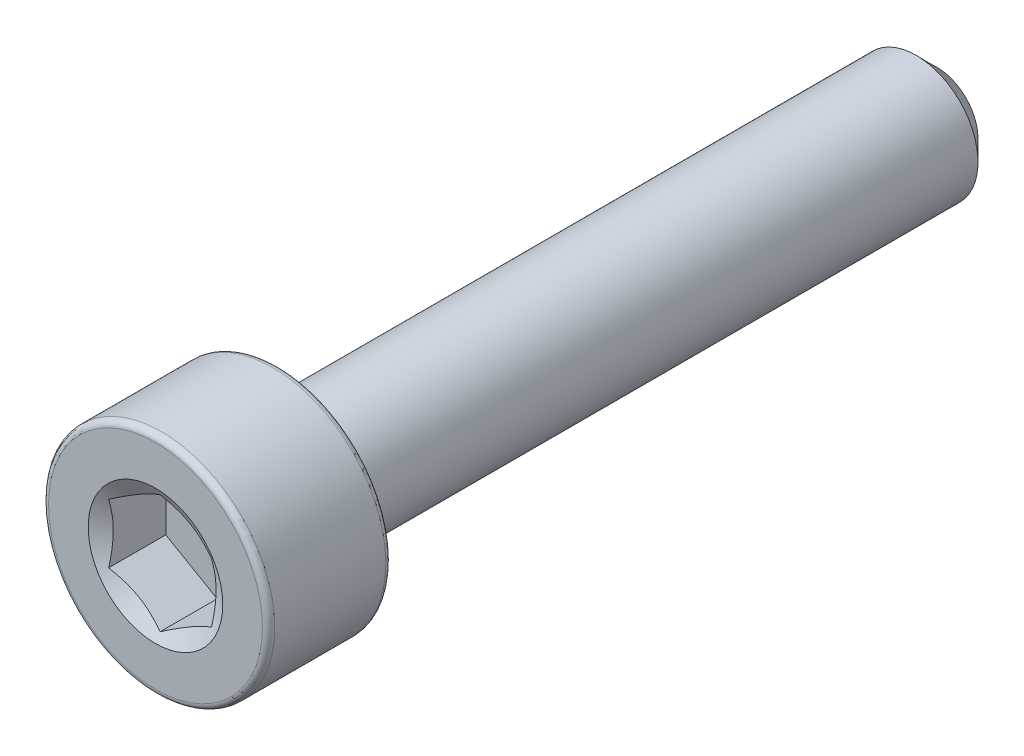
from build123d import *

# Parameters (mm, degrees)
CUT_EXTRUDE1_START = 9.5
CUT_EXTRUDE1_DEPTH = 1.5


with BuildPart() as part:
    # Sketch2 → Revolve1 (revolve)
    with BuildSketch(Plane(origin=(0, 0, 0), x_dir=(0, 0, -1), z_dir=(1, 0, 0)), mode=Mode.PRIVATE) as revolve1_sk:
        with BuildLine():
            Line((9.5, 0), (9.5, 1))
            Line((9.5, 1), (9, 1.5))
            Line((9, 1.5), (-6.5, 1.5))
            Line((-6.5, 1.5), (-6.5, 2.6))
            ThreePointArc((-6.5, 2.6), (-6.543933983, 2.706066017), (-6.65, 2.75))
            Line((-6.65, 2.75), (-9.35, 2.75))
            ThreePointArc((-9.35, 2.75), (-9.456066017, 2.706066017), (-9.5, 2.6))
            Line((-9.5, 2.6), (-9.5, 0))
            Line((-9.5, 0), (9.5, 0))
        make_face()
    revolve(revolve1_sk.sketch.rotate(Axis((0, 0, -9.5), (0, 0, 1)), 90), axis=Axis((0, 0, -9.5), (0, 0, 1)))

    # Sketch3 → Cut-Extrude1 (cut)
    with BuildSketch(Plane.XY.offset(CUT_EXTRUDE1_START)):
        Polygon((-1.25, 0.721687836), (-1.25, -0.721687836), (0, -1.443375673), (1.25, -0.721687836), (1.25, 0.721687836), (0, 1.443375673), align=None)
    extrude(amount=-CUT_EXTRUDE1_DEPTH, mode=Mode.SUBTRACT)

    # Cut-Extrude2 cone 1 section (on through the dimple's axis) → Cut-Extrude2 (revolve, cut)
    with BuildSketch(Plane(origin=(0, 0, 9.5), x_dir=(0, -1, 0), z_dir=(1, 0, 0))):
        Polygon((0, 0), (1.636146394, 0), (0, 0.944629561), align=None)
    revolve(axis=Axis((0, 0, 9.5), (0, 0, -1)), mode=Mode.SUBTRACT)


solid = part.part
